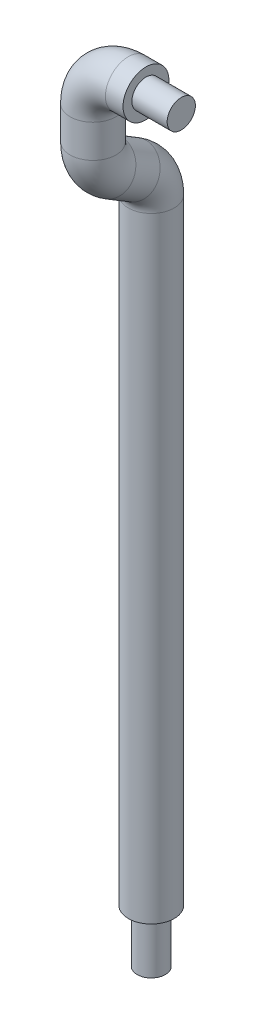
ISO-10303-21;
HEADER;
FILE_DESCRIPTION(('STEP AP214'),'2;1');
FILE_NAME('part.step','',(''),(''),'','','');
FILE_SCHEMA(('AUTOMOTIVE_DESIGN { 1 0 10303 214 1 1 1 1 }'));
ENDSEC;
DATA;
#1=APPLICATION_CONTEXT('core data for automotive mechanical design processes');
#2=APPLICATION_PROTOCOL_DEFINITION('international standard','automotive_design',2000,#1);
#3=PRODUCT_CONTEXT('',#1,'mechanical');
#4=PRODUCT('Part','Part','',(#3));
#5=PRODUCT_RELATED_PRODUCT_CATEGORY('part','',(#4));
#6=PRODUCT_DEFINITION_FORMATION('','',#4);
#7=PRODUCT_DEFINITION_CONTEXT('part definition',#1,'design');
#8=PRODUCT_DEFINITION('design','',#6,#7);
#9=PRODUCT_DEFINITION_SHAPE('','',#8);
#10=(LENGTH_UNIT() NAMED_UNIT(*) SI_UNIT(.MILLI.,.METRE.));
#11=(NAMED_UNIT(*) PLANE_ANGLE_UNIT() SI_UNIT($,.RADIAN.));
#12=(NAMED_UNIT(*) SI_UNIT($,.STERADIAN.) SOLID_ANGLE_UNIT());
#13=UNCERTAINTY_MEASURE_WITH_UNIT(LENGTH_MEASURE(1.E-05),#10,'distance_accuracy_value','');
#14=(GEOMETRIC_REPRESENTATION_CONTEXT(3) GLOBAL_UNCERTAINTY_ASSIGNED_CONTEXT((#13)) GLOBAL_UNIT_ASSIGNED_CONTEXT((#10,
#11,#12)) REPRESENTATION_CONTEXT('',''));
#15=CARTESIAN_POINT('',(0.,0.,0.));
#16=DIRECTION('',(0.,0.,1.));
#17=DIRECTION('',(1.,0.,0.));
#18=AXIS2_PLACEMENT_3D('',#15,#16,#17);
#19=CARTESIAN_POINT('',(8.,-8.,-17.25));
#20=DIRECTION('',(-1.,0.,0.));
#21=DIRECTION('',(0.,0.,1.));
#22=AXIS2_PLACEMENT_3D('',#19,#20,#21);
#23=PLANE('',#22);
#24=CARTESIAN_POINT('',(8.,-8.,-17.25));
#25=DIRECTION('',(1.,0.,0.));
#26=DIRECTION('',(0.,0.,-1.));
#27=AXIS2_PLACEMENT_3D('',#24,#25,#26);
#28=CIRCLE('',#27,0.4);
#29=CARTESIAN_POINT('',(8.,-8.,-17.65));
#30=VERTEX_POINT('',#29);
#31=EDGE_CURVE('E18',#30,#30,#28,.F.);
#32=ORIENTED_EDGE('',*,*,#31,.F.);
#33=EDGE_LOOP('',(#32));
#34=FACE_BOUND('',#33,.T.);
#35=ADVANCED_FACE('F15',(#34),#23,.F.);
#36=CARTESIAN_POINT('',(8.,-8.,-17.25));
#37=DIRECTION('',(1.,0.,0.));
#38=DIRECTION('',(0.,0.,-1.));
#39=AXIS2_PLACEMENT_3D('',#36,#37,#38);
#40=CYLINDRICAL_SURFACE('',#39,0.4);
#41=CARTESIAN_POINT('',(7.,-8.,-17.25));
#42=DIRECTION('',(1.,0.,0.));
#43=DIRECTION('',(0.,0.,-1.));
#44=AXIS2_PLACEMENT_3D('',#41,#42,#43);
#45=CIRCLE('',#44,0.4);
#46=CARTESIAN_POINT('',(7.,-8.,-17.65));
#47=VERTEX_POINT('',#46);
#48=EDGE_CURVE('E43',#47,#47,#45,.F.);
#49=ORIENTED_EDGE('',*,*,#48,.F.);
#50=EDGE_LOOP('',(#49));
#51=FACE_BOUND('',#50,.T.);
#52=ORIENTED_EDGE('',*,*,#31,.T.);
#53=EDGE_LOOP('',(#52));
#54=FACE_BOUND('',#53,.T.);
#55=ADVANCED_FACE('F50',(#51,#54),#40,.T.);
#56=CARTESIAN_POINT('',(7.,0.,0.));
#57=DIRECTION('',(1.,0.,0.));
#58=DIRECTION('',(0.,0.,-1.));
#59=AXIS2_PLACEMENT_3D('',#56,#57,#58);
#60=PLANE('',#59);
#61=ORIENTED_EDGE('',*,*,#48,.T.);
#62=EDGE_LOOP('',(#61));
#63=FACE_BOUND('',#62,.T.);
#64=CARTESIAN_POINT('',(7.,-8.,-17.25));
#65=DIRECTION('',(-1.,0.,0.));
#66=DIRECTION('',(0.,0.,1.));
#67=AXIS2_PLACEMENT_3D('',#64,#65,#66);
#68=CIRCLE('',#67,0.65);
#69=CARTESIAN_POINT('',(7.,-8.,-16.6));
#70=VERTEX_POINT('',#69);
#71=EDGE_CURVE('E40',#70,#70,#68,.T.);
#72=ORIENTED_EDGE('',*,*,#71,.F.);
#73=EDGE_LOOP('',(#72));
#74=FACE_BOUND('',#73,.T.);
#75=ADVANCED_FACE('F57',(#63,#74),#60,.T.);
#76=CARTESIAN_POINT('',(8.,-8.,-17.25));
#77=DIRECTION('',(-1.,0.,0.));
#78=DIRECTION('',(0.,0.,1.));
#79=AXIS2_PLACEMENT_3D('',#76,#77,#78);
#80=CYLINDRICAL_SURFACE('',#79,0.65);
#81=CARTESIAN_POINT('',(6.5,-8.,-17.25));
#82=DIRECTION('',(-1.,0.,0.));
#83=DIRECTION('',(0.,1.,0.));
#84=AXIS2_PLACEMENT_3D('',#81,#82,#83);
#85=CIRCLE('',#84,0.65);
#86=CARTESIAN_POINT('',(6.5,-7.35,-17.25));
#87=VERTEX_POINT('',#86);
#88=EDGE_CURVE('E42',#87,#87,#85,.T.);
#89=ORIENTED_EDGE('',*,*,#88,.F.);
#90=EDGE_LOOP('',(#89));
#91=FACE_BOUND('',#90,.T.);
#92=ORIENTED_EDGE('',*,*,#71,.T.);
#93=EDGE_LOOP('',(#92));
#94=FACE_BOUND('',#93,.T.);
#95=ADVANCED_FACE('F99',(#91,#94),#80,.T.);
#96=CARTESIAN_POINT('',(6.5,-9.,-17.25));
#97=DIRECTION('',(0.,0.,1.));
#98=DIRECTION('',(0.,-1.,0.));
#99=AXIS2_PLACEMENT_3D('',#96,#97,#98);
#100=TOROIDAL_SURFACE('',#99,1.,0.65);
#101=CARTESIAN_POINT('',(5.5,-9.,-17.25));
#102=DIRECTION('',(0.,-1.,0.));
#103=DIRECTION('',(0.,0.,-1.));
#104=AXIS2_PLACEMENT_3D('',#101,#102,#103);
#105=CIRCLE('',#104,0.65);
#106=CARTESIAN_POINT('',(5.5,-9.,-17.9));
#107=VERTEX_POINT('',#106);
#108=EDGE_CURVE('E31',#107,#107,#105,.T.);
#109=ORIENTED_EDGE('',*,*,#108,.F.);
#110=EDGE_LOOP('',(#109));
#111=FACE_BOUND('',#110,.T.);
#112=ORIENTED_EDGE('',*,*,#88,.T.);
#113=EDGE_LOOP('',(#112));
#114=FACE_BOUND('',#113,.T.);
#115=ADVANCED_FACE('F94',(#111,#114),#100,.T.);
#116=CARTESIAN_POINT('',(5.5,-9.,-17.25));
#117=DIRECTION('',(0.,-1.,0.));
#118=DIRECTION('',(0.,0.,-1.));
#119=AXIS2_PLACEMENT_3D('',#116,#117,#118);
#120=CYLINDRICAL_SURFACE('',#119,0.65);
#121=CARTESIAN_POINT('',(5.5,-9.936740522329,-17.25));
#122=DIRECTION('',(0.,-1.,0.));
#123=DIRECTION('',(0.,0.,1.));
#124=AXIS2_PLACEMENT_3D('',#121,#122,#123);
#125=CIRCLE('',#124,0.65);
#126=CARTESIAN_POINT('',(5.5,-9.936740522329,-16.6));
#127=VERTEX_POINT('',#126);
#128=EDGE_CURVE('E103',#127,#127,#125,.T.);
#129=ORIENTED_EDGE('',*,*,#128,.F.);
#130=EDGE_LOOP('',(#129));
#131=FACE_BOUND('',#130,.T.);
#132=ORIENTED_EDGE('',*,*,#108,.T.);
#133=EDGE_LOOP('',(#132));
#134=FACE_BOUND('',#133,.T.);
#135=ADVANCED_FACE('F90',(#131,#134),#120,.T.);
#136=CARTESIAN_POINT('',(5.5,-9.936740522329,-18.25));
#137=DIRECTION('',(1.,0.,0.));
#138=DIRECTION('',(0.,0.,-1.));
#139=AXIS2_PLACEMENT_3D('',#136,#137,#138);
#140=TOROIDAL_SURFACE('',#139,1.,0.65);
#141=CARTESIAN_POINT('',(5.5,-10.7919383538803,-17.7316982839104));
#142=DIRECTION('',(0.,-0.51830171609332,-0.855197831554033));
#143=DIRECTION('',(0.,0.855197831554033,-0.51830171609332));
#144=AXIS2_PLACEMENT_3D('',#141,#142,#143);
#145=CIRCLE('',#144,0.65);
#146=CARTESIAN_POINT('',(5.5,-10.2360597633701,-18.0685943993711));
#147=VERTEX_POINT('',#146);
#148=EDGE_CURVE('E39',#147,#147,#145,.T.);
#149=ORIENTED_EDGE('',*,*,#148,.F.);
#150=EDGE_LOOP('',(#149));
#151=FACE_BOUND('',#150,.T.);
#152=ORIENTED_EDGE('',*,*,#128,.T.);
#153=EDGE_LOOP('',(#152));
#154=FACE_BOUND('',#153,.T.);
#155=ADVANCED_FACE('F85',(#151,#154),#140,.T.);
#156=CARTESIAN_POINT('',(5.5,-31.,-18.9));
#157=DIRECTION('',(0.,-1.,0.));
#158=DIRECTION('',(0.,0.,-1.));
#159=AXIS2_PLACEMENT_3D('',#156,#157,#158);
#160=PLANE('',#159);
#161=CARTESIAN_POINT('',(5.5,-31.,-18.9));
#162=DIRECTION('',(0.,-1.,0.));
#163=DIRECTION('',(0.,0.,-1.));
#164=AXIS2_PLACEMENT_3D('',#161,#162,#163);
#165=CIRCLE('',#164,0.4);
#166=CARTESIAN_POINT('',(5.5,-31.,-19.3));
#167=VERTEX_POINT('',#166);
#168=EDGE_CURVE('E36',#167,#167,#165,.F.);
#169=ORIENTED_EDGE('',*,*,#168,.F.);
#170=EDGE_LOOP('',(#169));
#171=FACE_BOUND('',#170,.T.);
#172=ADVANCED_FACE('F89',(#171),#160,.T.);
#173=CARTESIAN_POINT('',(5.5,-10.79193835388,-17.73169828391));
#174=DIRECTION('',(0.,-0.51830171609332,-0.855197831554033));
#175=DIRECTION('',(0.,0.855197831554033,-0.51830171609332));
#176=AXIS2_PLACEMENT_3D('',#173,#174,#175);
#177=CYLINDRICAL_SURFACE('',#176,0.65);
#178=CARTESIAN_POINT('',(5.5,-11.2080616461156,-18.4183017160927));
#179=DIRECTION('',(0.,-0.518301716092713,-0.8551978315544));
#180=DIRECTION('',(0.,0.8551978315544,-0.518301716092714));
#181=AXIS2_PLACEMENT_3D('',#178,#179,#180);
#182=CIRCLE('',#181,0.65);
#183=CARTESIAN_POINT('',(5.5,-10.6521830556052,-18.755197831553));
#184=VERTEX_POINT('',#183);
#185=EDGE_CURVE('E35',#184,#184,#182,.T.);
#186=ORIENTED_EDGE('',*,*,#185,.F.);
#187=EDGE_LOOP('',(#186));
#188=FACE_BOUND('',#187,.T.);
#189=ORIENTED_EDGE('',*,*,#148,.T.);
#190=EDGE_LOOP('',(#189));
#191=FACE_BOUND('',#190,.T.);
#192=ADVANCED_FACE('F116',(#188,#191),#177,.T.);
#193=CARTESIAN_POINT('',(5.5,-21.,-18.9));
#194=DIRECTION('',(0.,-1.,0.));
#195=DIRECTION('',(0.,0.,-1.));
#196=AXIS2_PLACEMENT_3D('',#193,#194,#195);
#197=CYLINDRICAL_SURFACE('',#196,0.4);
#198=CARTESIAN_POINT('',(5.5,-29.5,-18.9));
#199=DIRECTION('',(0.,-1.,0.));
#200=DIRECTION('',(0.,0.,-1.));
#201=AXIS2_PLACEMENT_3D('',#198,#199,#200);
#202=CIRCLE('',#201,0.4);
#203=CARTESIAN_POINT('',(5.5,-29.5,-19.3));
#204=VERTEX_POINT('',#203);
#205=EDGE_CURVE('E27',#204,#204,#202,.F.);
#206=ORIENTED_EDGE('',*,*,#205,.F.);
#207=EDGE_LOOP('',(#206));
#208=FACE_BOUND('',#207,.T.);
#209=ORIENTED_EDGE('',*,*,#168,.T.);
#210=EDGE_LOOP('',(#209));
#211=FACE_BOUND('',#210,.T.);
#212=ADVANCED_FACE('F74',(#208,#211),#197,.T.);
#213=CARTESIAN_POINT('',(5.5,-12.06325947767,-17.9));
#214=DIRECTION('',(-1.,0.,0.));
#215=DIRECTION('',(0.,-0.855197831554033,0.518301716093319));
#216=AXIS2_PLACEMENT_3D('',#213,#214,#215);
#217=TOROIDAL_SURFACE('',#216,0.999999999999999,0.65);
#218=CARTESIAN_POINT('',(5.5,-12.06325947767,-18.9));
#219=DIRECTION('',(0.,-1.,0.));
#220=DIRECTION('',(0.,0.,-1.));
#221=AXIS2_PLACEMENT_3D('',#218,#219,#220);
#222=CIRCLE('',#221,0.65);
#223=CARTESIAN_POINT('',(5.5,-12.06325947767,-19.55));
#224=VERTEX_POINT('',#223);
#225=EDGE_CURVE('E22',#224,#224,#222,.T.);
#226=ORIENTED_EDGE('',*,*,#225,.F.);
#227=EDGE_LOOP('',(#226));
#228=FACE_BOUND('',#227,.T.);
#229=ORIENTED_EDGE('',*,*,#185,.T.);
#230=EDGE_LOOP('',(#229));
#231=FACE_BOUND('',#230,.T.);
#232=ADVANCED_FACE('F67',(#228,#231),#217,.T.);
#233=CARTESIAN_POINT('',(0.,-29.5,0.));
#234=DIRECTION('',(0.,-1.,0.));
#235=DIRECTION('',(0.,0.,-1.));
#236=AXIS2_PLACEMENT_3D('',#233,#234,#235);
#237=PLANE('',#236);
#238=ORIENTED_EDGE('',*,*,#205,.T.);
#239=EDGE_LOOP('',(#238));
#240=FACE_BOUND('',#239,.T.);
#241=CARTESIAN_POINT('',(5.5,-29.5,-18.9));
#242=DIRECTION('',(0.,-1.,0.));
#243=DIRECTION('',(0.,0.,-1.));
#244=AXIS2_PLACEMENT_3D('',#241,#242,#243);
#245=CIRCLE('',#244,0.65);
#246=CARTESIAN_POINT('',(5.5,-29.5,-19.55));
#247=VERTEX_POINT('',#246);
#248=EDGE_CURVE('E10',#247,#247,#245,.F.);
#249=ORIENTED_EDGE('',*,*,#248,.F.);
#250=EDGE_LOOP('',(#249));
#251=FACE_BOUND('',#250,.T.);
#252=ADVANCED_FACE('F61',(#240,#251),#237,.T.);
#253=CARTESIAN_POINT('',(5.5,-12.06325947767,-18.9));
#254=DIRECTION('',(0.,-1.,0.));
#255=DIRECTION('',(0.,0.,-1.));
#256=AXIS2_PLACEMENT_3D('',#253,#254,#255);
#257=CYLINDRICAL_SURFACE('',#256,0.65);
#258=ORIENTED_EDGE('',*,*,#225,.T.);
#259=EDGE_LOOP('',(#258));
#260=FACE_BOUND('',#259,.T.);
#261=ORIENTED_EDGE('',*,*,#248,.T.);
#262=EDGE_LOOP('',(#261));
#263=FACE_BOUND('',#262,.T.);
#264=ADVANCED_FACE('F59',(#260,#263),#257,.T.);
#265=CLOSED_SHELL('',(#35,#55,#75,#95,#115,#135,#155,#172,#192,#212,#232,#252,#264));
#266=MANIFOLD_SOLID_BREP('B1',#265);
#267=ADVANCED_BREP_SHAPE_REPRESENTATION('',(#18,#266),#14);
#268=SHAPE_DEFINITION_REPRESENTATION(#9,#267);
ENDSEC;
END-ISO-10303-21;
